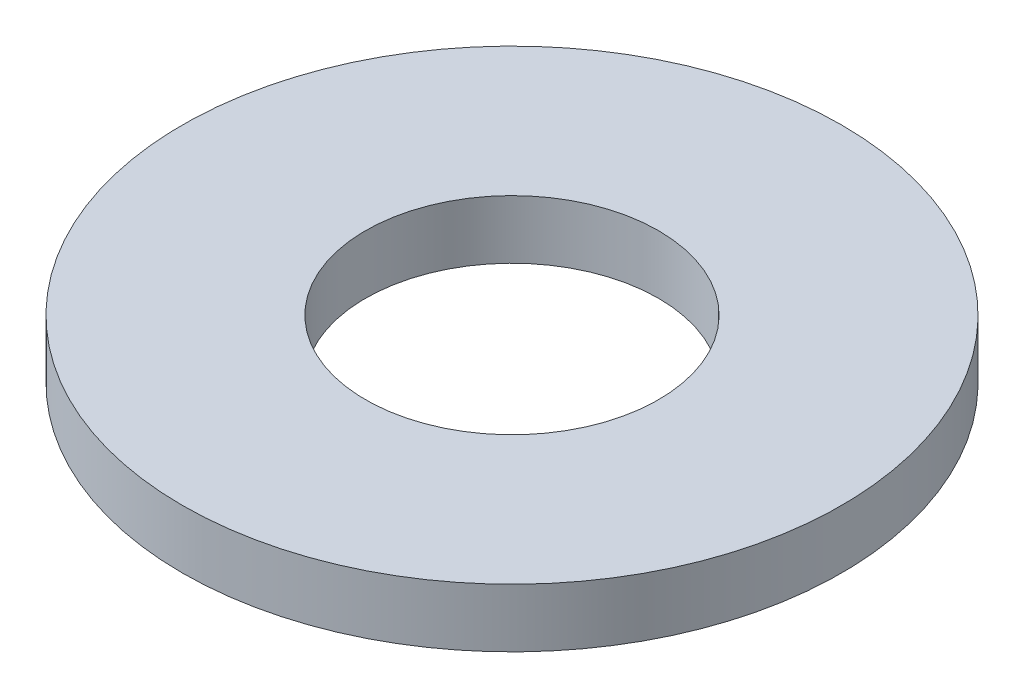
from build123d import *

# Parameters (mm, degrees)
ESQUISSE1_W = 2.5
ESQUISSE1_H = 0.8


with BuildPart() as part:
    # Esquisse1 → R_volution1 (revolve)
    with BuildSketch(Plane.XY, mode=Mode.PRIVATE) as r_volution1_sk:
        with Locations((3.25, 0.4)):
            Rectangle(ESQUISSE1_W, ESQUISSE1_H)
    revolve(r_volution1_sk.sketch.rotate(Axis((0, 0.8, 0), (0, -1, 0)), 270), axis=Axis((0, 0.8, 0), (0, -1, 0)))


solid = part.part
